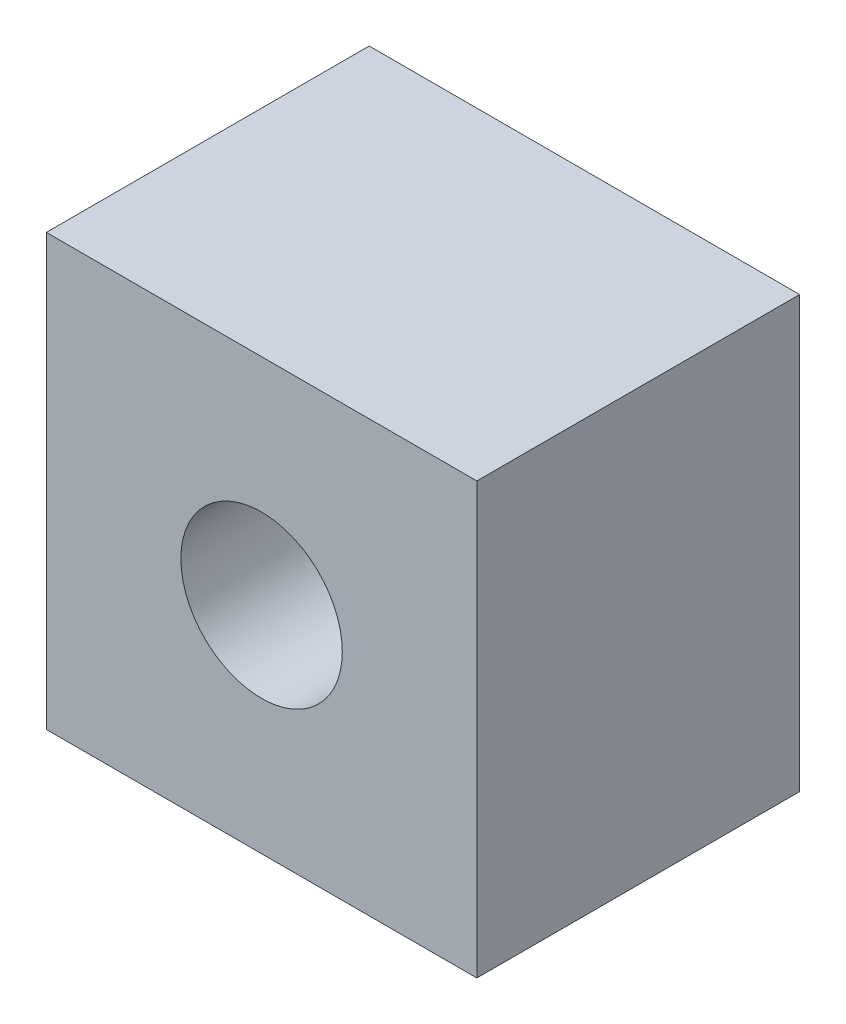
ISO-10303-21;
HEADER;
FILE_DESCRIPTION(('STEP AP214'),'2;1');
FILE_NAME('part.step','',(''),(''),'','','');
FILE_SCHEMA(('AUTOMOTIVE_DESIGN { 1 0 10303 214 1 1 1 1 }'));
ENDSEC;
DATA;
#1=APPLICATION_CONTEXT('core data for automotive mechanical design processes');
#2=APPLICATION_PROTOCOL_DEFINITION('international standard','automotive_design',2000,#1);
#3=PRODUCT_CONTEXT('',#1,'mechanical');
#4=PRODUCT('Part','Part','',(#3));
#5=PRODUCT_RELATED_PRODUCT_CATEGORY('part','',(#4));
#6=PRODUCT_DEFINITION_FORMATION('','',#4);
#7=PRODUCT_DEFINITION_CONTEXT('part definition',#1,'design');
#8=PRODUCT_DEFINITION('design','',#6,#7);
#9=PRODUCT_DEFINITION_SHAPE('','',#8);
#10=(LENGTH_UNIT() NAMED_UNIT(*) SI_UNIT(.MILLI.,.METRE.));
#11=(NAMED_UNIT(*) PLANE_ANGLE_UNIT() SI_UNIT($,.RADIAN.));
#12=(NAMED_UNIT(*) SI_UNIT($,.STERADIAN.) SOLID_ANGLE_UNIT());
#13=UNCERTAINTY_MEASURE_WITH_UNIT(LENGTH_MEASURE(1.E-05),#10,'distance_accuracy_value','');
#14=(GEOMETRIC_REPRESENTATION_CONTEXT(3) GLOBAL_UNCERTAINTY_ASSIGNED_CONTEXT((#13)) GLOBAL_UNIT_ASSIGNED_CONTEXT((#10,
#11,#12)) REPRESENTATION_CONTEXT('',''));
#15=CARTESIAN_POINT('',(0.,0.,0.));
#16=DIRECTION('',(0.,0.,1.));
#17=DIRECTION('',(1.,0.,0.));
#18=AXIS2_PLACEMENT_3D('',#15,#16,#17);
#19=CARTESIAN_POINT('',(-4.,-4.,6.));
#20=DIRECTION('',(0.,0.,1.));
#21=DIRECTION('',(1.,0.,0.));
#22=AXIS2_PLACEMENT_3D('',#19,#20,#21);
#23=PLANE('',#22);
#24=DIRECTION('',(0.,-1.,0.));
#25=VECTOR('',#24,1.);
#26=CARTESIAN_POINT('',(-4.,3.99999999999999,6.));
#27=LINE('',#26,#25);
#28=CARTESIAN_POINT('',(-4.,3.99999999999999,6.));
#29=VERTEX_POINT('',#28);
#30=CARTESIAN_POINT('',(-4.,-4.,6.));
#31=VERTEX_POINT('',#30);
#32=EDGE_CURVE('E100',#29,#31,#27,.T.);
#33=ORIENTED_EDGE('',*,*,#32,.T.);
#34=DIRECTION('',(1.,0.,0.));
#35=VECTOR('',#34,1.);
#36=CARTESIAN_POINT('',(-4.,-4.,6.));
#37=LINE('',#36,#35);
#38=CARTESIAN_POINT('',(4.,-4.,6.));
#39=VERTEX_POINT('',#38);
#40=EDGE_CURVE('E85',#31,#39,#37,.T.);
#41=ORIENTED_EDGE('',*,*,#40,.T.);
#42=DIRECTION('',(0.,1.,0.));
#43=VECTOR('',#42,1.);
#44=CARTESIAN_POINT('',(4.,3.99999999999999,6.));
#45=LINE('',#44,#43);
#46=CARTESIAN_POINT('',(4.,3.99999999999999,6.));
#47=VERTEX_POINT('',#46);
#48=EDGE_CURVE('E51',#39,#47,#45,.T.);
#49=ORIENTED_EDGE('',*,*,#48,.T.);
#50=DIRECTION('',(-1.,0.,0.));
#51=VECTOR('',#50,1.);
#52=CARTESIAN_POINT('',(-4.,3.99999999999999,6.));
#53=LINE('',#52,#51);
#54=EDGE_CURVE('E46',#47,#29,#53,.T.);
#55=ORIENTED_EDGE('',*,*,#54,.T.);
#56=EDGE_LOOP('',(#33,#41,#49,#55));
#57=FACE_BOUND('',#56,.T.);
#58=CARTESIAN_POINT('',(0.,0.,6.));
#59=DIRECTION('',(0.,0.,1.));
#60=DIRECTION('',(1.,0.,0.));
#61=AXIS2_PLACEMENT_3D('',#58,#59,#60);
#62=CIRCLE('',#61,1.5);
#63=CARTESIAN_POINT('',(1.5,0.,6.));
#64=VERTEX_POINT('',#63);
#65=EDGE_CURVE('E90',#64,#64,#62,.T.);
#66=ORIENTED_EDGE('',*,*,#65,.F.);
#67=EDGE_LOOP('',(#66));
#68=FACE_BOUND('',#67,.T.);
#69=ADVANCED_FACE('F31',(#57,#68),#23,.T.);
#70=CARTESIAN_POINT('',(-4.,-4.,0.));
#71=DIRECTION('',(0.,0.,1.));
#72=DIRECTION('',(1.,0.,0.));
#73=AXIS2_PLACEMENT_3D('',#70,#71,#72);
#74=PLANE('',#73);
#75=DIRECTION('',(0.,-1.,0.));
#76=VECTOR('',#75,1.);
#77=CARTESIAN_POINT('',(-4.,3.99999999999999,0.));
#78=LINE('',#77,#76);
#79=CARTESIAN_POINT('',(-4.,3.99999999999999,0.));
#80=VERTEX_POINT('',#79);
#81=CARTESIAN_POINT('',(-4.,-4.,0.));
#82=VERTEX_POINT('',#81);
#83=EDGE_CURVE('E77',#80,#82,#78,.T.);
#84=ORIENTED_EDGE('',*,*,#83,.F.);
#85=DIRECTION('',(-1.,0.,0.));
#86=VECTOR('',#85,1.);
#87=CARTESIAN_POINT('',(-4.,3.99999999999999,0.));
#88=LINE('',#87,#86);
#89=CARTESIAN_POINT('',(4.,3.99999999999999,0.));
#90=VERTEX_POINT('',#89);
#91=EDGE_CURVE('E98',#90,#80,#88,.T.);
#92=ORIENTED_EDGE('',*,*,#91,.F.);
#93=DIRECTION('',(0.,1.,0.));
#94=VECTOR('',#93,1.);
#95=CARTESIAN_POINT('',(4.,3.99999999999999,0.));
#96=LINE('',#95,#94);
#97=CARTESIAN_POINT('',(4.,-4.,0.));
#98=VERTEX_POINT('',#97);
#99=EDGE_CURVE('E78',#98,#90,#96,.T.);
#100=ORIENTED_EDGE('',*,*,#99,.F.);
#101=DIRECTION('',(1.,0.,0.));
#102=VECTOR('',#101,1.);
#103=CARTESIAN_POINT('',(-4.,-4.,0.));
#104=LINE('',#103,#102);
#105=EDGE_CURVE('E72',#82,#98,#104,.T.);
#106=ORIENTED_EDGE('',*,*,#105,.F.);
#107=EDGE_LOOP('',(#84,#92,#100,#106));
#108=FACE_BOUND('',#107,.T.);
#109=CARTESIAN_POINT('',(0.,0.,0.));
#110=DIRECTION('',(0.,0.,1.));
#111=DIRECTION('',(1.,0.,0.));
#112=AXIS2_PLACEMENT_3D('',#109,#110,#111);
#113=CIRCLE('',#112,1.5);
#114=CARTESIAN_POINT('',(1.5,0.,0.));
#115=VERTEX_POINT('',#114);
#116=EDGE_CURVE('E93',#115,#115,#113,.T.);
#117=ORIENTED_EDGE('',*,*,#116,.T.);
#118=EDGE_LOOP('',(#117));
#119=FACE_BOUND('',#118,.T.);
#120=ADVANCED_FACE('F73',(#108,#119),#74,.F.);
#121=CARTESIAN_POINT('',(-4.,3.99999999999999,6.));
#122=DIRECTION('',(1.,0.,0.));
#123=DIRECTION('',(0.,1.,0.));
#124=AXIS2_PLACEMENT_3D('',#121,#122,#123);
#125=PLANE('',#124);
#126=ORIENTED_EDGE('',*,*,#83,.T.);
#127=DIRECTION('',(0.,0.,-1.));
#128=VECTOR('',#127,1.);
#129=CARTESIAN_POINT('',(-4.,-4.,6.));
#130=LINE('',#129,#128);
#131=EDGE_CURVE('E11',#31,#82,#130,.T.);
#132=ORIENTED_EDGE('',*,*,#131,.F.);
#133=ORIENTED_EDGE('',*,*,#32,.F.);
#134=DIRECTION('',(0.,0.,-1.));
#135=VECTOR('',#134,1.);
#136=CARTESIAN_POINT('',(-4.,3.99999999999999,6.));
#137=LINE('',#136,#135);
#138=EDGE_CURVE('E89',#29,#80,#137,.T.);
#139=ORIENTED_EDGE('',*,*,#138,.T.);
#140=EDGE_LOOP('',(#126,#132,#133,#139));
#141=FACE_BOUND('',#140,.T.);
#142=ADVANCED_FACE('F33',(#141),#125,.F.);
#143=CARTESIAN_POINT('',(-4.,-4.,6.));
#144=DIRECTION('',(0.,1.,0.));
#145=DIRECTION('',(0.,0.,1.));
#146=AXIS2_PLACEMENT_3D('',#143,#144,#145);
#147=PLANE('',#146);
#148=ORIENTED_EDGE('',*,*,#105,.T.);
#149=DIRECTION('',(0.,0.,-1.));
#150=VECTOR('',#149,1.);
#151=CARTESIAN_POINT('',(4.,-4.,6.));
#152=LINE('',#151,#150);
#153=EDGE_CURVE('E39',#39,#98,#152,.T.);
#154=ORIENTED_EDGE('',*,*,#153,.F.);
#155=ORIENTED_EDGE('',*,*,#40,.F.);
#156=ORIENTED_EDGE('',*,*,#131,.T.);
#157=EDGE_LOOP('',(#148,#154,#155,#156));
#158=FACE_BOUND('',#157,.T.);
#159=ADVANCED_FACE('F84',(#158),#147,.F.);
#160=CARTESIAN_POINT('',(4.,3.99999999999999,6.));
#161=DIRECTION('',(-1.,0.,0.));
#162=DIRECTION('',(0.,-1.,0.));
#163=AXIS2_PLACEMENT_3D('',#160,#161,#162);
#164=PLANE('',#163);
#165=ORIENTED_EDGE('',*,*,#99,.T.);
#166=DIRECTION('',(0.,0.,-1.));
#167=VECTOR('',#166,1.);
#168=CARTESIAN_POINT('',(4.,3.99999999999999,6.));
#169=LINE('',#168,#167);
#170=EDGE_CURVE('E106',#47,#90,#169,.T.);
#171=ORIENTED_EDGE('',*,*,#170,.F.);
#172=ORIENTED_EDGE('',*,*,#48,.F.);
#173=ORIENTED_EDGE('',*,*,#153,.T.);
#174=EDGE_LOOP('',(#165,#171,#172,#173));
#175=FACE_BOUND('',#174,.T.);
#176=ADVANCED_FACE('F109',(#175),#164,.F.);
#177=CARTESIAN_POINT('',(-4.,3.99999999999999,6.));
#178=DIRECTION('',(0.,-1.,0.));
#179=DIRECTION('',(0.,0.,-1.));
#180=AXIS2_PLACEMENT_3D('',#177,#178,#179);
#181=PLANE('',#180);
#182=ORIENTED_EDGE('',*,*,#91,.T.);
#183=ORIENTED_EDGE('',*,*,#138,.F.);
#184=ORIENTED_EDGE('',*,*,#54,.F.);
#185=ORIENTED_EDGE('',*,*,#170,.T.);
#186=EDGE_LOOP('',(#182,#183,#184,#185));
#187=FACE_BOUND('',#186,.T.);
#188=ADVANCED_FACE('F111',(#187),#181,.F.);
#189=CARTESIAN_POINT('',(0.,0.,6.));
#190=DIRECTION('',(0.,0.,-1.));
#191=DIRECTION('',(-1.,0.,0.));
#192=AXIS2_PLACEMENT_3D('',#189,#190,#191);
#193=CYLINDRICAL_SURFACE('',#192,1.5);
#194=ORIENTED_EDGE('',*,*,#65,.T.);
#195=EDGE_LOOP('',(#194));
#196=FACE_BOUND('',#195,.T.);
#197=ORIENTED_EDGE('',*,*,#116,.F.);
#198=EDGE_LOOP('',(#197));
#199=FACE_BOUND('',#198,.T.);
#200=ADVANCED_FACE('F117',(#196,#199),#193,.F.);
#201=CLOSED_SHELL('',(#69,#120,#142,#159,#176,#188,#200));
#202=MANIFOLD_SOLID_BREP('B2',#201);
#203=ADVANCED_BREP_SHAPE_REPRESENTATION('',(#18,#202),#14);
#204=SHAPE_DEFINITION_REPRESENTATION(#9,#203);
ENDSEC;
END-ISO-10303-21;
